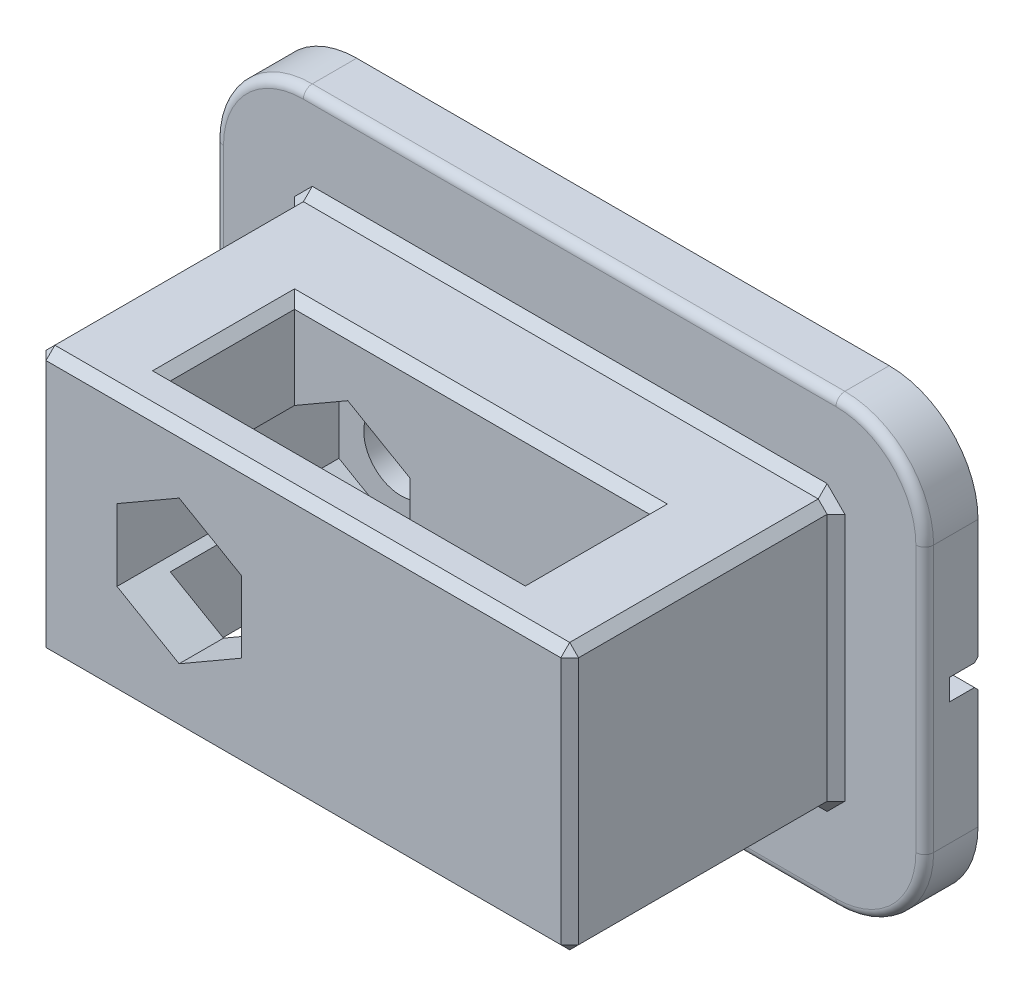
from build123d import *

# Parameters (mm, degrees)
BOSS_EXTRU_1_DEPTH      = 3
ESQUISSE2_W             = 30
ESQUISSE2_H             = 15
BOSS_EXTRU_2_DEPTH      = 15
ESQUISSE3_W             = 20
ESQUISSE3_H             = 7
ENL_V_MAT_EXTRU_1_DEPTH = 49.207883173
ENL_V_MAT_EXTRU_3_DEPTH = 12.5
ESQUISSE5_R             = 2.1
ENL_V_MAT_EXTRU_4_DEPTH = 49.79805324
CHANFREIN1_SIZE         = 0.5
CONG_1_R                = 0.5
ESQUISSE6_W             = 44.347229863
ESQUISSE6_H             = 1.2
ENL_V_MAT_EXTRU_5_DEPTH = 1.6
CHANFREIN2_SIZE         = 0.2


with BuildPart() as part:
    # Esquisse1 → Boss.-Extru.1 (new body)
    with BuildSketch(Plane.XY):
        with BuildLine():
            Line((5, 0), (35, 0))
            ThreePointArc((35, 0), (38.535533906, 1.464466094), (40, 5))
            Line((40, 5), (40, 20))
            ThreePointArc((40, 20), (38.535533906, 23.535533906), (35, 25))
            Line((35, 25), (5, 25))
            ThreePointArc((5, 25), (1.464466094, 23.535533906), (0, 20))
            Line((0, 20), (0, 5))
            ThreePointArc((0, 5), (1.464466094, 1.464466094), (5, 0))
        make_face()
    extrude(amount=BOSS_EXTRU_1_DEPTH)

    # Esquisse2 → Boss.-Extru.2 (add)
    with BuildSketch(Plane.XY.offset(3)):
        with Locations((20, 12.5)):
            Rectangle(ESQUISSE2_W, ESQUISSE2_H)
    extrude(amount=BOSS_EXTRU_2_DEPTH)

    # Esquisse3 → Enl_v. mat.-Extru.1 (cut, through all)
    with BuildSketch(Plane(origin=(0, 20, 0), x_dir=(1, 0, 0), z_dir=(0, 1, 0))):
        with Locations((20, -12)):
            Rectangle(ESQUISSE3_W, ESQUISSE3_H)
    extrude(amount=-ENL_V_MAT_EXTRU_1_DEPTH, mode=Mode.SUBTRACT)

    # Esquisse4 → Enl_v. mat.-Extru.3 (cut)
    with BuildSketch(Plane.XY.offset(18)):
        Polygon((13, 16.541451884), (9.5, 14.520725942), (9.5, 10.479274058), (13, 8.458548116), (16.5, 10.479274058), (16.5, 14.520725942), align=None)
    extrude(amount=-ENL_V_MAT_EXTRU_3_DEPTH, mode=Mode.SUBTRACT)

    # Esquisse5 → Enl_v. mat.-Extru.4 (cut, through all)
    with BuildSketch(Plane.XY.offset(5.5)):
        with Locations((13, 12.5)):
            Circle(ESQUISSE5_R)
    extrude(amount=-ENL_V_MAT_EXTRU_4_DEPTH, mode=Mode.SUBTRACT)

    # Chanfrein1
    chanfrein1_edges = [part.edges().sort_by_distance(p)[0] for p in [
        (5, 12.5, 3),
        (5, 20, 10.5),
        (20, 5, 3),
        (5, 5, 10.5),
        (35, 12.5, 3),
        (35, 5, 10.5),
        (20, 20, 3),
        (35, 20, 10.5),
        (5, 12.5, 18),
        (20, 5, 18),
        (35, 12.5, 18),
        (20, 20, 18),
        (10, 5, 12),
        (20, 5, 8.5),
        (30, 5, 12),
        (20, 5, 15.5),
        (10, 20, 12),
        (20, 20, 15.5),
        (30, 20, 12),
        (20, 20, 8.5),
    ]]
    chamfer(chanfrein1_edges, length=CHANFREIN1_SIZE)

    # Cong_1
    cong_1_edges = [part.edges().sort_by_distance(p)[0] for p in [
        (1.464466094, 23.535533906, 3),
        (0, 12.5, 3),
        (1.464466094, 1.464466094, 3),
        (20, 0, 3),
        (38.535533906, 1.464466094, 3),
        (40, 12.5, 3),
        (38.535533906, 23.535533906, 3),
        (20, 25, 3),
    ]]
    fillet(cong_1_edges, radius=CONG_1_R)

    # Esquisse6 → Enl_v. mat.-Extru.5 (cut)
    with BuildSketch(Plane(origin=(0, 0, 0), x_dir=(-1, 0, 0), z_dir=(0, 0, -1))):
        with Locations((-20.23785761, 12.5)):
            Rectangle(ESQUISSE6_W, ESQUISSE6_H)
    extrude(amount=-ENL_V_MAT_EXTRU_5_DEPTH, mode=Mode.SUBTRACT)

    # Chanfrein2
    chanfrein2_edges = [part.edges().sort_by_distance(p)[0] for p in [
        (5.49376941, 11.9, 0),
        (5.49376941, 13.1, 0),
        (27.50623059, 13.1, 0),
        (27.50623059, 11.9, 0),
    ]]
    chamfer(chanfrein2_edges, length=CHANFREIN2_SIZE)


solid = part.part
